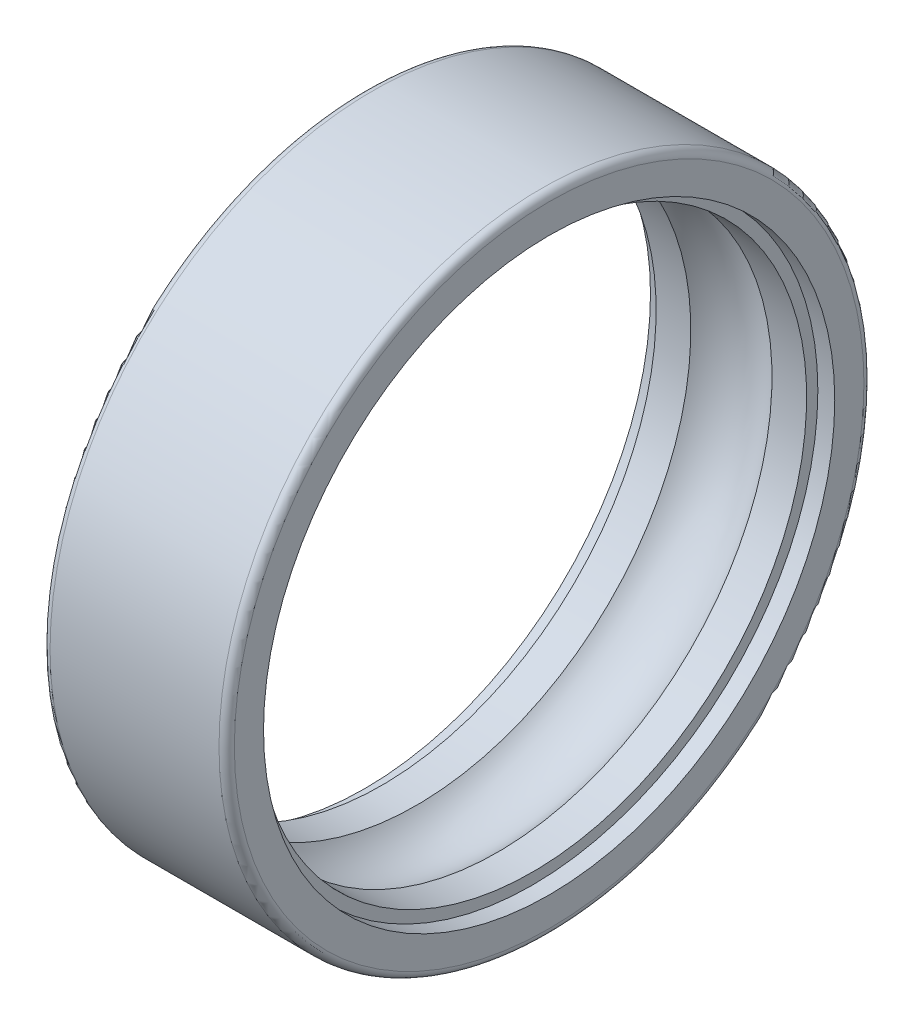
from build123d import *


with BuildPart() as part:
    # Esquisse1 → Base-R_volution (revolve)
    with BuildSketch(Plane.XY, mode=Mode.PRIVATE) as base_r_volution_sk:
        with BuildLine():
            Line((2.643028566, 17.87), (4.9, 17.87))
            Line((4.9, 17.87), (4.9, 18.6))
            Line((4.9, 18.6), (6, 18.6))
            Line((6, 18.6), (6, 20.5))
            ThreePointArc((6, 20.5), (5.853553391, 20.853553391), (5.5, 21))
            Line((5.5, 21), (-5.5, 21))
            ThreePointArc((-5.5, 21), (-5.853553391, 20.853553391), (-6, 20.5))
            Line((-6, 20.5), (-6, 18.6))
            Line((-6, 18.6), (-4.9, 18.6))
            Line((-4.9, 18.6), (-4.9, 17.87))
            Line((-4.9, 17.87), (-2.643028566, 17.87))
            ThreePointArc((-2.643028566, 17.87), (0, 19.05), (2.643028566, 17.87))
        make_face()
    revolve(base_r_volution_sk.sketch.rotate(Axis((-18.28731444, 0, 0), (1, 0, 0)), 90), axis=Axis((-18.28731444, 0, 0), (1, 0, 0)))


solid = part.part
